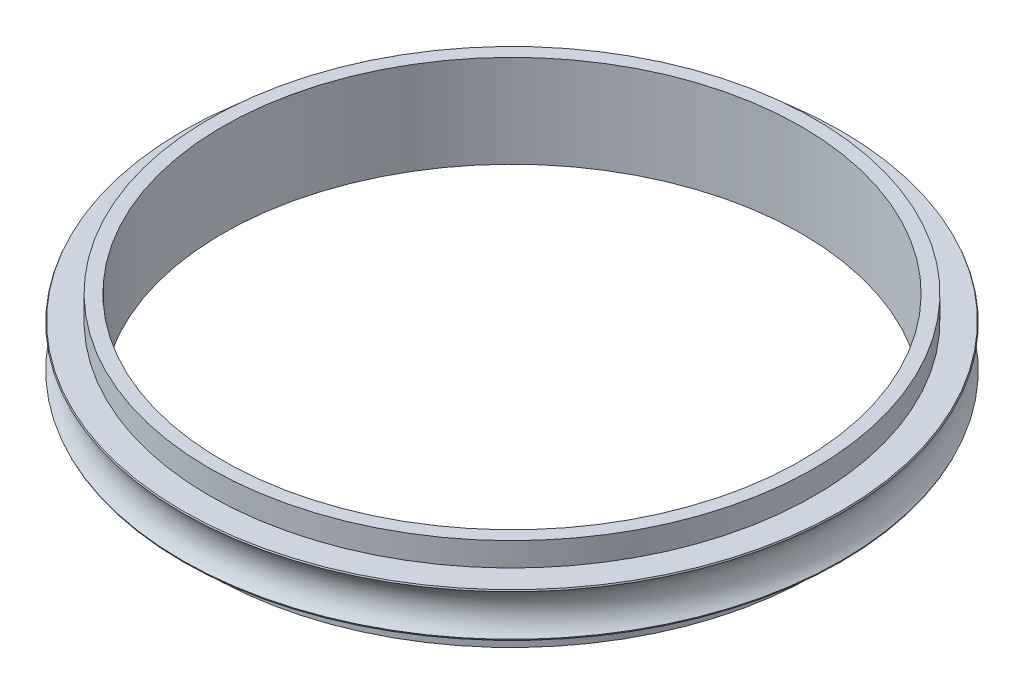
ISO-10303-21;
HEADER;
FILE_DESCRIPTION(('STEP AP214'),'2;1');
FILE_NAME('part.step','',(''),(''),'','','');
FILE_SCHEMA(('AUTOMOTIVE_DESIGN { 1 0 10303 214 1 1 1 1 }'));
ENDSEC;
DATA;
#1=APPLICATION_CONTEXT('core data for automotive mechanical design processes');
#2=APPLICATION_PROTOCOL_DEFINITION('international standard','automotive_design',2000,#1);
#3=PRODUCT_CONTEXT('',#1,'mechanical');
#4=PRODUCT('Part','Part','',(#3));
#5=PRODUCT_RELATED_PRODUCT_CATEGORY('part','',(#4));
#6=PRODUCT_DEFINITION_FORMATION('','',#4);
#7=PRODUCT_DEFINITION_CONTEXT('part definition',#1,'design');
#8=PRODUCT_DEFINITION('design','',#6,#7);
#9=PRODUCT_DEFINITION_SHAPE('','',#8);
#10=(LENGTH_UNIT() NAMED_UNIT(*) SI_UNIT(.MILLI.,.METRE.));
#11=(NAMED_UNIT(*) PLANE_ANGLE_UNIT() SI_UNIT($,.RADIAN.));
#12=(NAMED_UNIT(*) SI_UNIT($,.STERADIAN.) SOLID_ANGLE_UNIT());
#13=UNCERTAINTY_MEASURE_WITH_UNIT(LENGTH_MEASURE(1.E-05),#10,'distance_accuracy_value','');
#14=(GEOMETRIC_REPRESENTATION_CONTEXT(3) GLOBAL_UNCERTAINTY_ASSIGNED_CONTEXT((#13)) GLOBAL_UNIT_ASSIGNED_CONTEXT((#10,
#11,#12)) REPRESENTATION_CONTEXT('',''));
#15=CARTESIAN_POINT('',(0.,0.,0.));
#16=DIRECTION('',(0.,0.,1.));
#17=DIRECTION('',(1.,0.,0.));
#18=AXIS2_PLACEMENT_3D('',#15,#16,#17);
#19=CARTESIAN_POINT('',(0.,-1.95,0.));
#20=DIRECTION('',(0.,1.,0.));
#21=DIRECTION('',(0.,0.,1.));
#22=AXIS2_PLACEMENT_3D('',#19,#20,#21);
#23=CONICAL_SURFACE('',#22,28.423115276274,0.389555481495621);
#24=CARTESIAN_POINT('',(0.,-1.77884460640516,0.));
#25=DIRECTION('',(0.,-1.,0.));
#26=DIRECTION('',(0.,0.,-1.));
#27=AXIS2_PLACEMENT_3D('',#24,#25,#26);
#28=CIRCLE('',#27,28.4933806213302);
#29=CARTESIAN_POINT('',(0.,-1.77884460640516,-28.4933806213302));
#30=VERTEX_POINT('',#29);
#31=EDGE_CURVE('E69',#30,#30,#28,.T.);
#32=ORIENTED_EDGE('',*,*,#31,.T.);
#33=EDGE_LOOP('',(#32));
#34=FACE_BOUND('',#33,.T.);
#35=CARTESIAN_POINT('',(0.,-1.9,0.));
#36=DIRECTION('',(0.,-1.,0.));
#37=DIRECTION('',(0.,0.,-1.));
#38=AXIS2_PLACEMENT_3D('',#35,#36,#37);
#39=CIRCLE('',#38,28.4436420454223);
#40=CARTESIAN_POINT('',(0.,-1.9,-28.4436420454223));
#41=VERTEX_POINT('',#40);
#42=EDGE_CURVE('E39',#41,#41,#39,.F.);
#43=ORIENTED_EDGE('',*,*,#42,.T.);
#44=EDGE_LOOP('',(#43));
#45=FACE_BOUND('',#44,.T.);
#46=ADVANCED_FACE('F35',(#34,#45),#23,.T.);
#47=CARTESIAN_POINT('',(0.,1.77884427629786,0.));
#48=DIRECTION('',(0.,-1.,0.));
#49=DIRECTION('',(0.,0.,-1.));
#50=AXIS2_PLACEMENT_3D('',#47,#48,#49);
#51=CONICAL_SURFACE('',#50,28.49338021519,0.389555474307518);
#52=CARTESIAN_POINT('',(0.,1.77884427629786,0.));
#53=DIRECTION('',(0.,-1.,0.));
#54=DIRECTION('',(0.,0.,-1.));
#55=AXIS2_PLACEMENT_3D('',#52,#53,#54);
#56=CIRCLE('',#55,28.49338021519);
#57=CARTESIAN_POINT('',(0.,1.77884427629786,-28.49338021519));
#58=VERTEX_POINT('',#57);
#59=EDGE_CURVE('E48',#58,#58,#56,.T.);
#60=ORIENTED_EDGE('',*,*,#59,.F.);
#61=EDGE_LOOP('',(#60));
#62=FACE_BOUND('',#61,.T.);
#63=CARTESIAN_POINT('',(0.,1.9,0.));
#64=DIRECTION('',(0.,1.,0.));
#65=DIRECTION('',(0.,0.,1.));
#66=AXIS2_PLACEMENT_3D('',#63,#64,#65);
#67=CIRCLE('',#66,28.4436415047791);
#68=CARTESIAN_POINT('',(0.,1.9,28.4436415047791));
#69=VERTEX_POINT('',#68);
#70=EDGE_CURVE('E51',#69,#69,#67,.F.);
#71=ORIENTED_EDGE('',*,*,#70,.T.);
#72=EDGE_LOOP('',(#71));
#73=FACE_BOUND('',#72,.T.);
#74=ADVANCED_FACE('F78',(#62,#73),#51,.T.);
#75=CARTESIAN_POINT('',(0.,3.54792879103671E-08,0.));
#76=DIRECTION('',(0.,-1.,0.));
#77=DIRECTION('',(0.,0.,-1.));
#78=AXIS2_PLACEMENT_3D('',#75,#76,#77);
#79=TOROIDAL_SURFACE('',#78,30.2500000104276,2.4999999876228);
#80=ORIENTED_EDGE('',*,*,#59,.T.);
#81=EDGE_LOOP('',(#80));
#82=FACE_BOUND('',#81,.T.);
#83=ORIENTED_EDGE('',*,*,#31,.F.);
#84=EDGE_LOOP('',(#83));
#85=FACE_BOUND('',#84,.T.);
#86=ADVANCED_FACE('F75',(#82,#85),#79,.F.);
#87=CARTESIAN_POINT('',(0.,-78.0133693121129,0.));
#88=DIRECTION('',(0.,1.,0.));
#89=DIRECTION('',(0.,0.,1.));
#90=AXIS2_PLACEMENT_3D('',#87,#88,#89);
#91=CYLINDRICAL_SURFACE('',#90,26.15);
#92=CARTESIAN_POINT('',(0.,3.95,0.));
#93=DIRECTION('',(0.,1.,0.));
#94=DIRECTION('',(0.,0.,1.));
#95=AXIS2_PLACEMENT_3D('',#92,#93,#94);
#96=CIRCLE('',#95,26.15);
#97=CARTESIAN_POINT('',(0.,3.95,26.15));
#98=VERTEX_POINT('',#97);
#99=EDGE_CURVE('E58',#98,#98,#96,.T.);
#100=ORIENTED_EDGE('',*,*,#99,.F.);
#101=EDGE_LOOP('',(#100));
#102=FACE_BOUND('',#101,.T.);
#103=CARTESIAN_POINT('',(0.,1.9,0.));
#104=DIRECTION('',(0.,-1.,0.));
#105=DIRECTION('',(0.,0.,-1.));
#106=AXIS2_PLACEMENT_3D('',#103,#104,#105);
#107=CIRCLE('',#106,26.15);
#108=CARTESIAN_POINT('',(0.,1.9,-26.15));
#109=VERTEX_POINT('',#108);
#110=EDGE_CURVE('E54',#109,#109,#107,.T.);
#111=ORIENTED_EDGE('',*,*,#110,.F.);
#112=EDGE_LOOP('',(#111));
#113=FACE_BOUND('',#112,.T.);
#114=ADVANCED_FACE('F86',(#102,#113),#91,.T.);
#115=CARTESIAN_POINT('',(25.,-4.05,0.));
#116=DIRECTION('',(0.,-1.,0.));
#117=DIRECTION('',(0.,0.,-1.));
#118=AXIS2_PLACEMENT_3D('',#115,#116,#117);
#119=PLANE('',#118);
#120=CARTESIAN_POINT('',(0.,-4.05,0.));
#121=DIRECTION('',(0.,-1.,0.));
#122=DIRECTION('',(0.,0.,-1.));
#123=AXIS2_PLACEMENT_3D('',#120,#121,#122);
#124=CIRCLE('',#123,25.);
#125=CARTESIAN_POINT('',(0.,-4.05,-25.));
#126=VERTEX_POINT('',#125);
#127=EDGE_CURVE('E10',#126,#126,#124,.T.);
#128=ORIENTED_EDGE('',*,*,#127,.F.);
#129=EDGE_LOOP('',(#128));
#130=FACE_BOUND('',#129,.T.);
#131=CARTESIAN_POINT('',(0.,-4.05,0.));
#132=DIRECTION('',(0.,-1.,0.));
#133=DIRECTION('',(0.,0.,-1.));
#134=AXIS2_PLACEMENT_3D('',#131,#132,#133);
#135=CIRCLE('',#134,26.15);
#136=CARTESIAN_POINT('',(0.,-4.05,-26.15));
#137=VERTEX_POINT('',#136);
#138=EDGE_CURVE('E53',#137,#137,#135,.F.);
#139=ORIENTED_EDGE('',*,*,#138,.F.);
#140=EDGE_LOOP('',(#139));
#141=FACE_BOUND('',#140,.T.);
#142=ADVANCED_FACE('F37',(#130,#141),#119,.T.);
#143=CARTESIAN_POINT('',(0.,3.95,0.));
#144=DIRECTION('',(0.,-1.,0.));
#145=DIRECTION('',(0.,0.,-1.));
#146=AXIS2_PLACEMENT_3D('',#143,#144,#145);
#147=CYLINDRICAL_SURFACE('',#146,25.);
#148=ORIENTED_EDGE('',*,*,#127,.T.);
#149=EDGE_LOOP('',(#148));
#150=FACE_BOUND('',#149,.T.);
#151=CARTESIAN_POINT('',(0.,3.95,0.));
#152=DIRECTION('',(0.,-1.,0.));
#153=DIRECTION('',(0.,0.,-1.));
#154=AXIS2_PLACEMENT_3D('',#151,#152,#153);
#155=CIRCLE('',#154,25.);
#156=CARTESIAN_POINT('',(0.,3.95,-25.));
#157=VERTEX_POINT('',#156);
#158=EDGE_CURVE('E43',#157,#157,#155,.T.);
#159=ORIENTED_EDGE('',*,*,#158,.F.);
#160=EDGE_LOOP('',(#159));
#161=FACE_BOUND('',#160,.T.);
#162=ADVANCED_FACE('F94',(#150,#161),#147,.F.);
#163=CARTESIAN_POINT('',(26.,3.95,0.));
#164=DIRECTION('',(0.,1.,0.));
#165=DIRECTION('',(0.,0.,1.));
#166=AXIS2_PLACEMENT_3D('',#163,#164,#165);
#167=PLANE('',#166);
#168=ORIENTED_EDGE('',*,*,#158,.T.);
#169=EDGE_LOOP('',(#168));
#170=FACE_BOUND('',#169,.T.);
#171=ORIENTED_EDGE('',*,*,#99,.T.);
#172=EDGE_LOOP('',(#171));
#173=FACE_BOUND('',#172,.T.);
#174=ADVANCED_FACE('F91',(#170,#173),#167,.T.);
#175=ORIENTED_EDGE('',*,*,#138,.T.);
#176=EDGE_LOOP('',(#175));
#177=FACE_BOUND('',#176,.T.);
#178=CARTESIAN_POINT('',(0.,-1.9,0.));
#179=DIRECTION('',(0.,-1.,0.));
#180=DIRECTION('',(0.,0.,-1.));
#181=AXIS2_PLACEMENT_3D('',#178,#179,#180);
#182=CIRCLE('',#181,26.15);
#183=CARTESIAN_POINT('',(0.,-1.9,-26.15));
#184=VERTEX_POINT('',#183);
#185=EDGE_CURVE('E65',#184,#184,#182,.T.);
#186=ORIENTED_EDGE('',*,*,#185,.T.);
#187=EDGE_LOOP('',(#186));
#188=FACE_BOUND('',#187,.T.);
#189=ADVANCED_FACE('F93',(#177,#188),#91,.T.);
#190=CARTESIAN_POINT('',(-34.2457076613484,1.9,0.));
#191=DIRECTION('',(0.,1.,0.));
#192=DIRECTION('',(0.,0.,1.));
#193=AXIS2_PLACEMENT_3D('',#190,#191,#192);
#194=PLANE('',#193);
#195=ORIENTED_EDGE('',*,*,#70,.F.);
#196=EDGE_LOOP('',(#195));
#197=FACE_BOUND('',#196,.T.);
#198=ORIENTED_EDGE('',*,*,#110,.T.);
#199=EDGE_LOOP('',(#198));
#200=FACE_BOUND('',#199,.T.);
#201=ADVANCED_FACE('F113',(#197,#200),#194,.T.);
#202=CARTESIAN_POINT('',(-34.2457076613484,-1.9,0.));
#203=DIRECTION('',(0.,-1.,0.));
#204=DIRECTION('',(0.,0.,-1.));
#205=AXIS2_PLACEMENT_3D('',#202,#203,#204);
#206=PLANE('',#205);
#207=ORIENTED_EDGE('',*,*,#42,.F.);
#208=EDGE_LOOP('',(#207));
#209=FACE_BOUND('',#208,.T.);
#210=ORIENTED_EDGE('',*,*,#185,.F.);
#211=EDGE_LOOP('',(#210));
#212=FACE_BOUND('',#211,.T.);
#213=ADVANCED_FACE('F118',(#209,#212),#206,.T.);
#214=CLOSED_SHELL('',(#46,#74,#86,#114,#142,#162,#174,#189,#201,#213));
#215=MANIFOLD_SOLID_BREP('B2',#214);
#216=ADVANCED_BREP_SHAPE_REPRESENTATION('',(#18,#215),#14);
#217=SHAPE_DEFINITION_REPRESENTATION(#9,#216);
ENDSEC;
END-ISO-10303-21;
